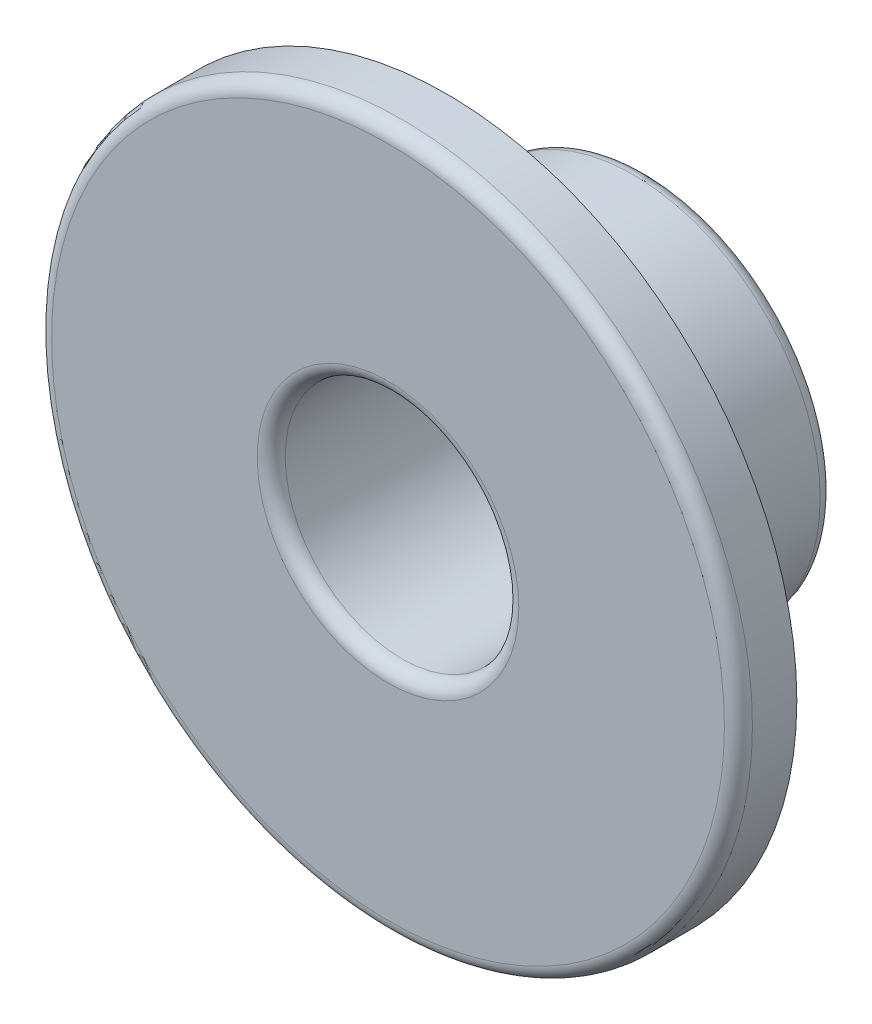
from build123d import *

# Parameters (mm, degrees)
SKETCH1_R          = 19.05
EXTRUDE1_DEPTH     = 3.175
SKETCH2_R          = 10.16
EXTRUDE2_DEPTH     = 10.922
SKETCH3_R          = 6.35
CUT_EXTRUDE1_DEPTH = 31.406091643
FILLET1_R          = 0.762


with BuildPart() as part:
    # Sketch1 → Extrude1 (new body)
    with BuildSketch(Plane.XY):
        Circle(SKETCH1_R)
    extrude(amount=EXTRUDE1_DEPTH)

    # Sketch2 → Extrude2 (add)
    with BuildSketch(Plane(origin=(0, 0, 0), x_dir=(-1, 0, 0), z_dir=(0, 0, -1))):
        with Locations(Location((0, 0, 0), (0, 0, 180))):
            Circle(SKETCH2_R)
    extrude(amount=EXTRUDE2_DEPTH)

    # Sketch3 → Cut-Extrude1 (cut, through all)
    with BuildSketch(Plane.XY.offset(3.175)):
        Circle(SKETCH3_R)
    extrude(amount=-CUT_EXTRUDE1_DEPTH, mode=Mode.SUBTRACT)

    # Fillet1
    fillet1_edges = [part.edges().sort_by_distance(p)[0] for p in [
        (-6.35, 0, -10.922),
        (-6.35, 0, 3.175),
        (-19.05, 0, 3.175),
        (-10.16, 0, -10.922),
    ]]
    fillet(fillet1_edges, radius=FILLET1_R)


solid = part.part
